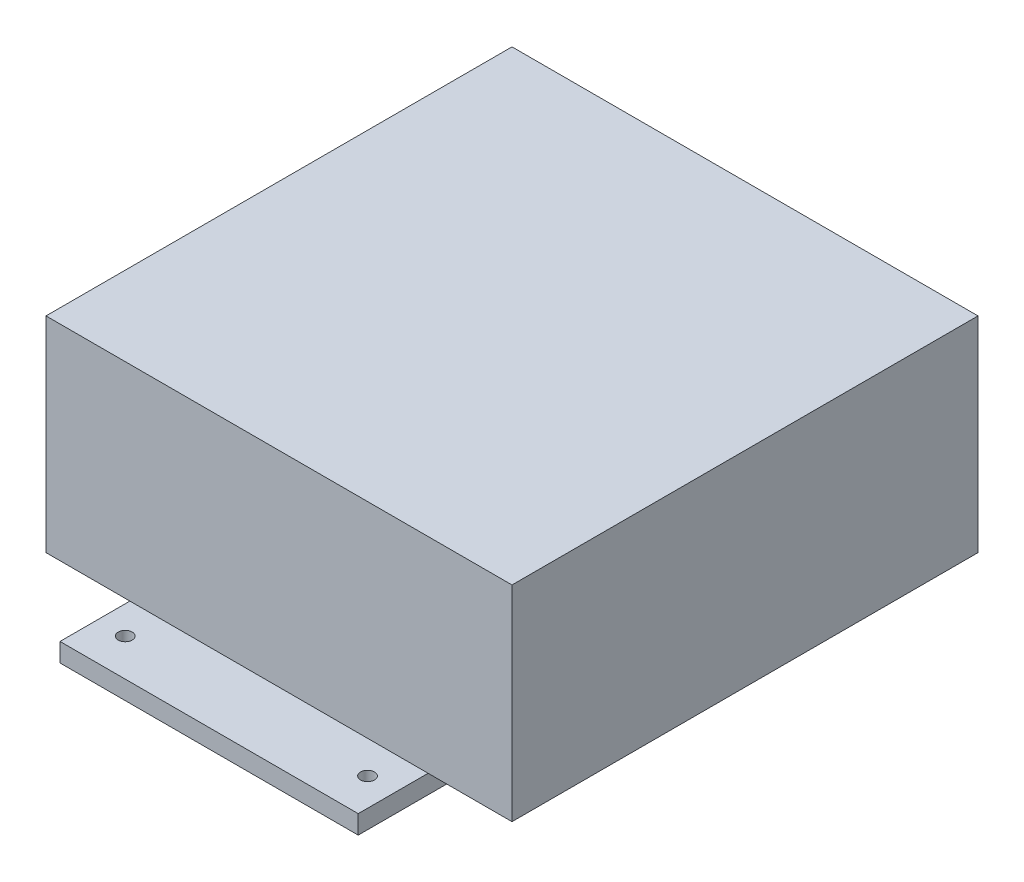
from build123d import *

# Parameters (mm, degrees)
SKETCH_1_W      = 32
SKETCH_1_H      = 65
SKETCH_1_R      = 0.75
EXTRUDE_1_DEPTH = 2
SKETCH_2_W      = 50
SKETCH_2_H      = 50
EXTRUDE_2_DEPTH = 22


with BuildPart() as part:
    # Sketch 1 → Extrude 1 (new body)
    with BuildSketch(Plane(origin=(0, 0, 0), x_dir=(1, 0, 0), z_dir=(0, 1, 0))):
        Rectangle(SKETCH_1_W, SKETCH_1_H)
        with Locations(Location((-13, 28.5, 0), (0, 0, 270))):
            Circle(SKETCH_1_R, mode=Mode.SUBTRACT)
        with Locations(Location((13, 28.5, 0), (0, 0, 270))):
            Circle(SKETCH_1_R, mode=Mode.SUBTRACT)
        with Locations(Location((13, -28.5, 0), (0, 0, 270))):
            Circle(SKETCH_1_R, mode=Mode.SUBTRACT)
        with Locations(Location((-13, -28.5, 0), (0, 0, 270))):
            Circle(SKETCH_1_R, mode=Mode.SUBTRACT)
    extrude(amount=EXTRUDE_1_DEPTH)

    # Sketch 2 → Extrude 2 (add)
    with BuildSketch(Plane(origin=(0, 2, 0), x_dir=(1, 0, 0), z_dir=(0, 1, 0))):
        Rectangle(SKETCH_2_W, SKETCH_2_H)
    extrude(amount=EXTRUDE_2_DEPTH)


solid = part.part
